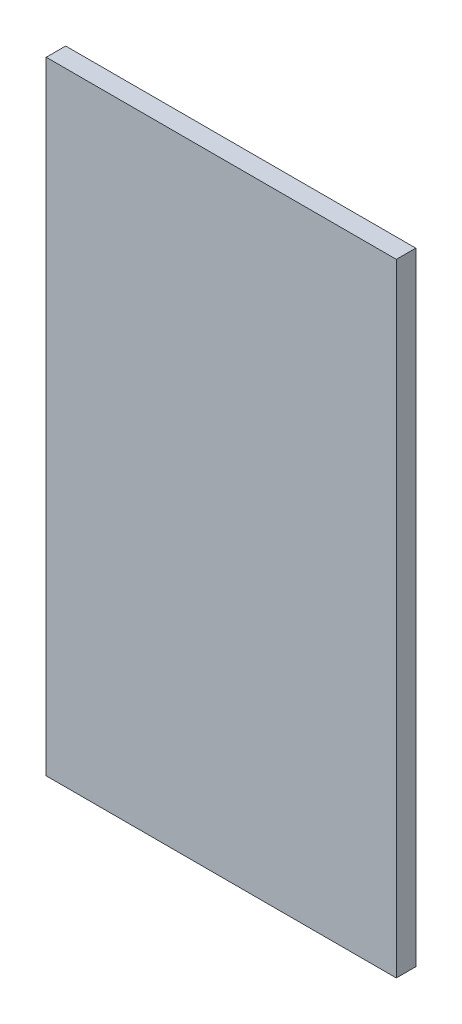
from build123d import *

# Parameters (mm, degrees)
SKETCH1_W           = 90
SKETCH1_H           = 160
BOSS_EXTRUDE1_DEPTH = 5


with BuildPart() as part:
    # Sketch1 → Boss-Extrude1 (new body)
    with BuildSketch(Plane.XY):
        with Locations((-45, -28.505006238)):
            Rectangle(SKETCH1_W, SKETCH1_H)
    extrude(amount=BOSS_EXTRUDE1_DEPTH)


solid = part.part
